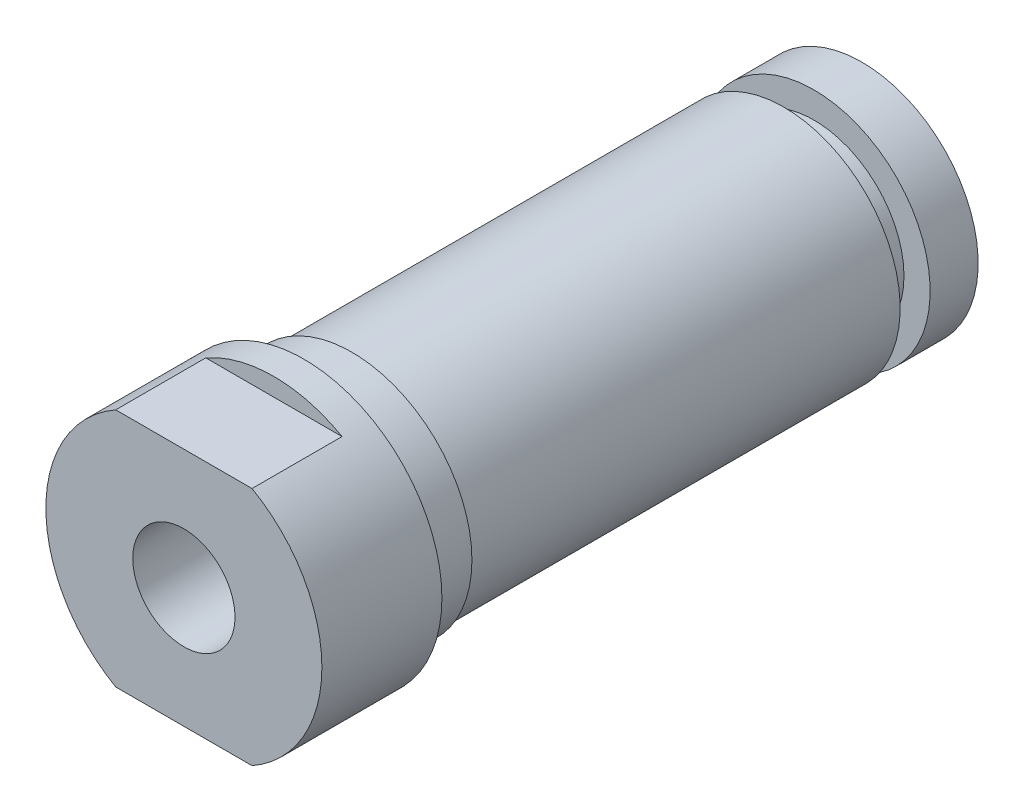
from build123d import *

# Parameters (mm, degrees)
SKETCH1_R               = 7.3025
EXTRUDE1_DEPTH          = 6.35
SKETCH2_R               = 6.35
EXTRUDE2_DEPTH          = 2.54
SKETCH3_R               = 6.1468
EXTRUDE3_DEPTH          = 22.86
SKETCH4_R               = 4.7625
EXTRUDE4_DEPTH          = 1.5875
SKETCH5_R               = 6.1468
EXTRUDE5_DEPTH          = 2.54
F_1_4_28_TAPPED_HOLE1_D = 5.4102
SKETCH8_W               = 4.7625
SKETCH8_H               = 0.9525
CUT_EXTRUDE1_DEPTH      = 12.7


with BuildPart() as part:
    # Sketch1 → Extrude1 (new body)
    with BuildSketch(Plane.XY):
        Circle(SKETCH1_R)
    extrude(amount=-EXTRUDE1_DEPTH)

    # Sketch2 → Extrude2 (add)
    with BuildSketch(Plane(origin=(0, 0, -6.35), x_dir=(-1, 0, 0), z_dir=(0, 0, -1))):
        with Locations(Location((0, 0, 0), (0, 0, 180))):
            Circle(SKETCH2_R)
    extrude(amount=EXTRUDE2_DEPTH)

    # Sketch3 → Extrude3 (add)
    with BuildSketch(Plane(origin=(0, 0, -8.89), x_dir=(-1, 0, 0), z_dir=(0, 0, -1))):
        Circle(SKETCH3_R)
    extrude(amount=EXTRUDE3_DEPTH)

    # Sketch4 → Extrude4 (add)
    with BuildSketch(Plane(origin=(0, 0, -31.75), x_dir=(-1, 0, 0), z_dir=(0, 0, -1))):
        Circle(SKETCH4_R)
    extrude(amount=EXTRUDE4_DEPTH)

    # Sketch5 → Extrude5 (add)
    with BuildSketch(Plane(origin=(0, 0, -33.3375), x_dir=(-1, 0, 0), z_dir=(0, 0, -1))):
        Circle(SKETCH5_R)
    extrude(amount=EXTRUDE5_DEPTH)

    # 1_4-28 Tapped Hole1 (through all)
    with Locations(Plane(origin=(0, 0, -35.8775), x_dir=(-1, 0, 0), z_dir=(0, 0, -1))):
        with Locations((0, 0)):
            Hole(F_1_4_28_TAPPED_HOLE1_D / 2)

    # Sketch8 → Cut-Extrude1 (cut, symmetric)
    with BuildSketch(Plane(origin=(0, 0, 0), x_dir=(0, 0, -1), z_dir=(1, 0, 0))):
        with Locations((2.38125, 6.82625)):
            Rectangle(SKETCH8_W, SKETCH8_H)
        with Locations((2.38125, -6.82625)):
            Rectangle(SKETCH8_W, SKETCH8_H)
    extrude(amount=CUT_EXTRUDE1_DEPTH, both=True, mode=Mode.SUBTRACT)


solid = part.part
